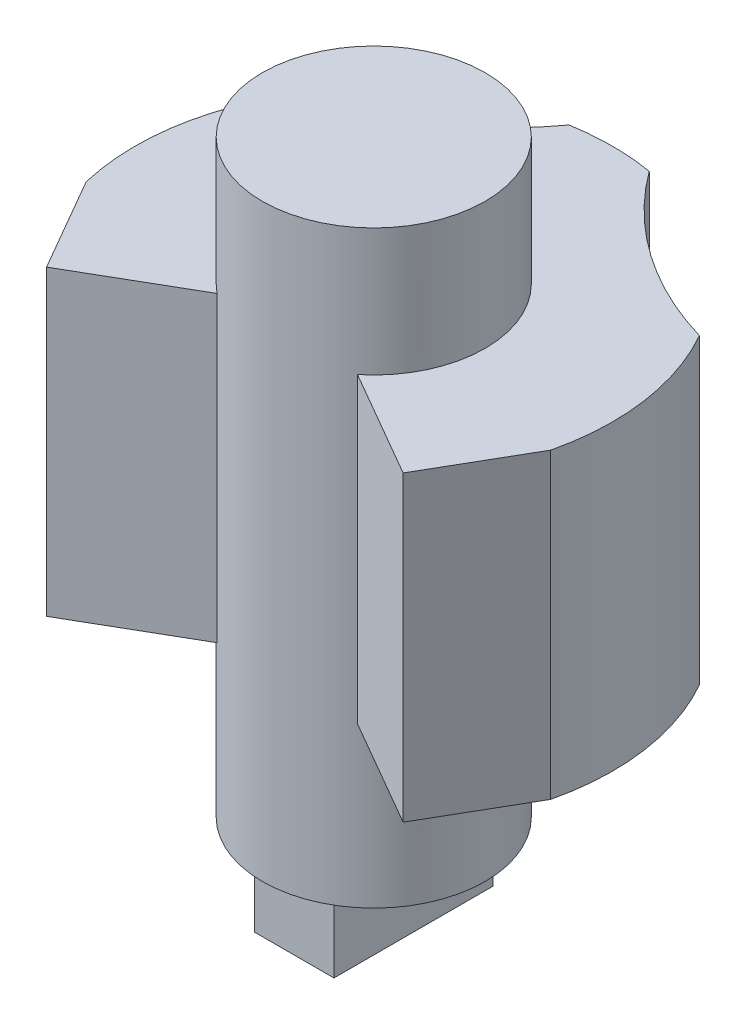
from build123d import *
from build123d.topology import SkipClean

# Parameters (mm, degrees)
BASE_EXTRUDE_DEPTH  = 12.065
SKETCH2_R           = 4.445
BOSS_EXTRUDE1_DEPTH = 5.08
BOSS_EXTRUDE2_START = 6.35
SKETCH3_R           = 4.445
BOSS_EXTRUDE2_DEPTH = 6.35
SKETCH5_W           = 3.175
SKETCH5_H           = 6.35
BOSS_EXTRUDE3_DEPTH = 3.175


with BuildPart() as part:
    # Sketch1 → Base-Extrude (new body)
    with BuildSketch(Plane(origin=(0, 0, 0), x_dir=(1, 0, 0), z_dir=(0, 1, 0))):
        with BuildLine():
            Line((2.80185865, -3.45074095), (7.111438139, -5.938877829))
            Line((7.111438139, -5.938877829), (9.265607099, -2.207747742))
            ThreePointArc((9.265607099, -2.207747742), (9.429198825, 1.347529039), (8.276322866, 4.71466911))
            ThreePointArc((8.276322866, 4.71466911), (4.552762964, 6.502019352), (1.59967064, 9.389711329))
            ThreePointArc((1.59967064, 9.389711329), (0.80269066, 9.491117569), (0, 9.525))
            Line((0, 9.525), (0, -4.445))
            ThreePointArc((0, -4.445), (1.486519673, -4.189067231), (2.80185865, -3.45074095))
        make_face()
    extrude(amount=BASE_EXTRUDE_DEPTH)

    # Boss-Mirror1: part across plane


with BuildPart() as part_1:
    add(part.part)
    add(part.part.mirror(Plane(origin=(0, 12.065, -9.525), x_dir=(0, 0, 1), z_dir=(1, 0, 0))))

    # Sketch2 → Boss-Extrude1 (add)
    with SkipClean():  # the faces are left unmerged after this step: merging them gives an invalid solid
        with BuildSketch(Plane(origin=(0, 12.065, 0), x_dir=(-1, 0, 0), z_dir=(0, 1, 0))):
            with Locations(Location((0, 0, 0), (0, 0, 50.924832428))):
                Circle(SKETCH2_R)
        extrude(amount=BOSS_EXTRUDE1_DEPTH)

    # Sketch3 → Boss-Extrude2 (add)
    with BuildSketch(Plane.XZ.offset(BOSS_EXTRUDE2_START)):
        with Locations(Location((0, 0, 0), (0, 0, 270))):
            Circle(SKETCH3_R)
    extrude(amount=-BOSS_EXTRUDE2_DEPTH)

    # Sketch5 → Boss-Extrude3 (add)
    with BuildSketch(Plane.XZ.offset(6.35)):
        Rectangle(SKETCH5_W, SKETCH5_H)
    extrude(amount=BOSS_EXTRUDE3_DEPTH)


solid = part_1.part
